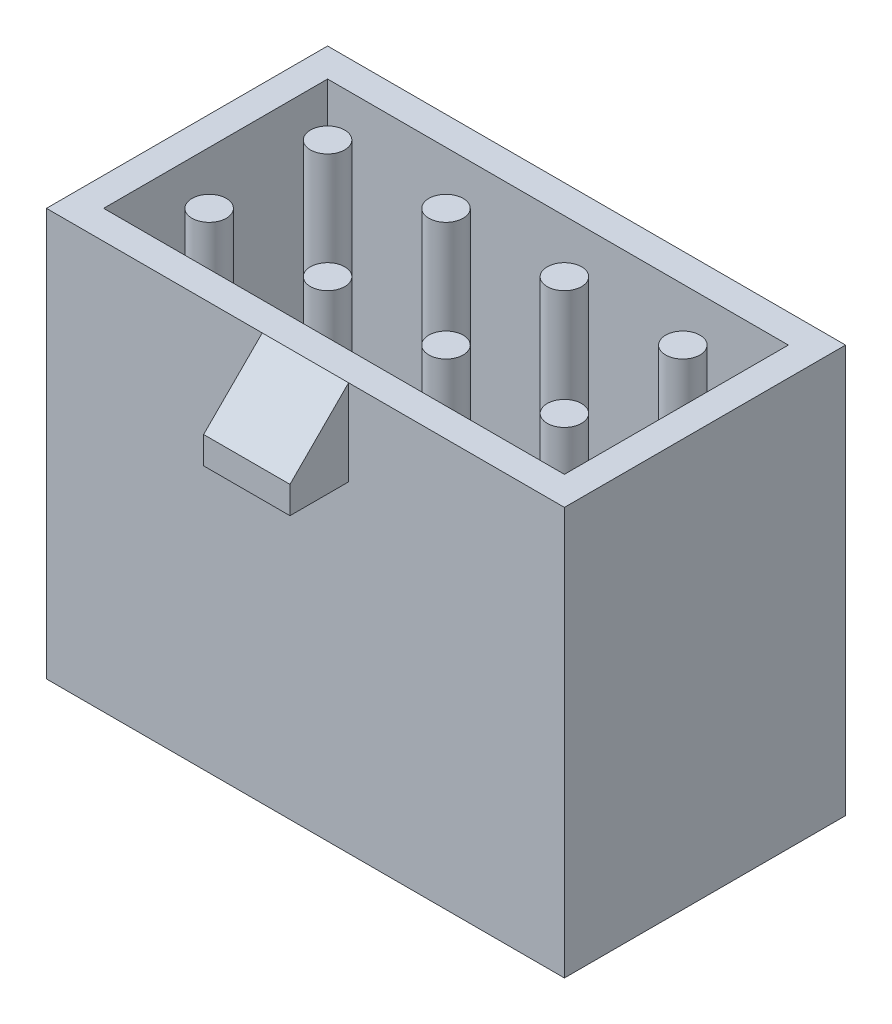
from build123d import *

# Parameters (mm, degrees)
SKETCH1_W          = 18.11
SKETCH1_H          = 9.83
EXTRUDE1_DEPTH     = 14.25
SKETCH2_W          = 16.11
SKETCH2_H          = 7.83
SKETCH2_R          = 0.6
CUT_EXTRUDE1_DEPTH = 10
SKETCH3_W          = 3.02
SKETCH3_H          = 3
EXTRUDE2_DEPTH     = 2.05
CHAMFER1_SIZE      = 2.05


with BuildPart() as part:
    # Sketch1 → Extrude1 (new body)
    with BuildSketch(Plane(origin=(0, 0, 0), x_dir=(1, 0, 0), z_dir=(0, 1, 0))):
        with Locations((9.055, 4.915)):
            Rectangle(SKETCH1_W, SKETCH1_H)
    extrude(amount=EXTRUDE1_DEPTH)

    # Sketch2 → Cut-Extrude1 (cut)
    with BuildSketch(Plane(origin=(0, 14.25, 0), x_dir=(-1, 0, 0), z_dir=(0, 1, 0))):
        with Locations((-9.055, -4.915)):
            Rectangle(SKETCH2_W, SKETCH2_H)
        with Locations(Location((-15.265, -2.845, 0), (0, 0, 90))):
            Circle(SKETCH2_R, mode=Mode.SUBTRACT)
        with Locations(Location((-11.125, -2.845, 0), (0, 0, 90))):
            Circle(SKETCH2_R, mode=Mode.SUBTRACT)
        with Locations(Location((-11.125, -6.985, 0), (0, 0, 270))):
            Circle(SKETCH2_R, mode=Mode.SUBTRACT)
        with Locations(Location((-15.265, -6.985, 0), (0, 0, 270))):
            Circle(SKETCH2_R, mode=Mode.SUBTRACT)
        with Locations(Location((-2.845, -6.985, 0), (0, 0, 90))):
            Circle(SKETCH2_R, mode=Mode.SUBTRACT)
        with Locations(Location((-6.985, -6.985, 0), (0, 0, 90))):
            Circle(SKETCH2_R, mode=Mode.SUBTRACT)
        with Locations(Location((-6.985, -2.845, 0), (0, 0, 270))):
            Circle(SKETCH2_R, mode=Mode.SUBTRACT)
        with Locations(Location((-2.845, -2.845, 0), (0, 0, 270))):
            Circle(SKETCH2_R, mode=Mode.SUBTRACT)
    extrude(amount=-CUT_EXTRUDE1_DEPTH, mode=Mode.SUBTRACT)

    # Sketch3 → Extrude2 (add)
    with BuildSketch(Plane.XY):
        with Locations((9.055, 12.75)):
            Rectangle(SKETCH3_W, SKETCH3_H)
    extrude(amount=EXTRUDE2_DEPTH)

    # Chamfer1
    chamfer1_edges = [part.edges().sort_by_distance(p)[0] for p in [
        (9.055, 14.25, 2.05),
    ]]
    chamfer(chamfer1_edges, length=CHAMFER1_SIZE)


solid = part.part
